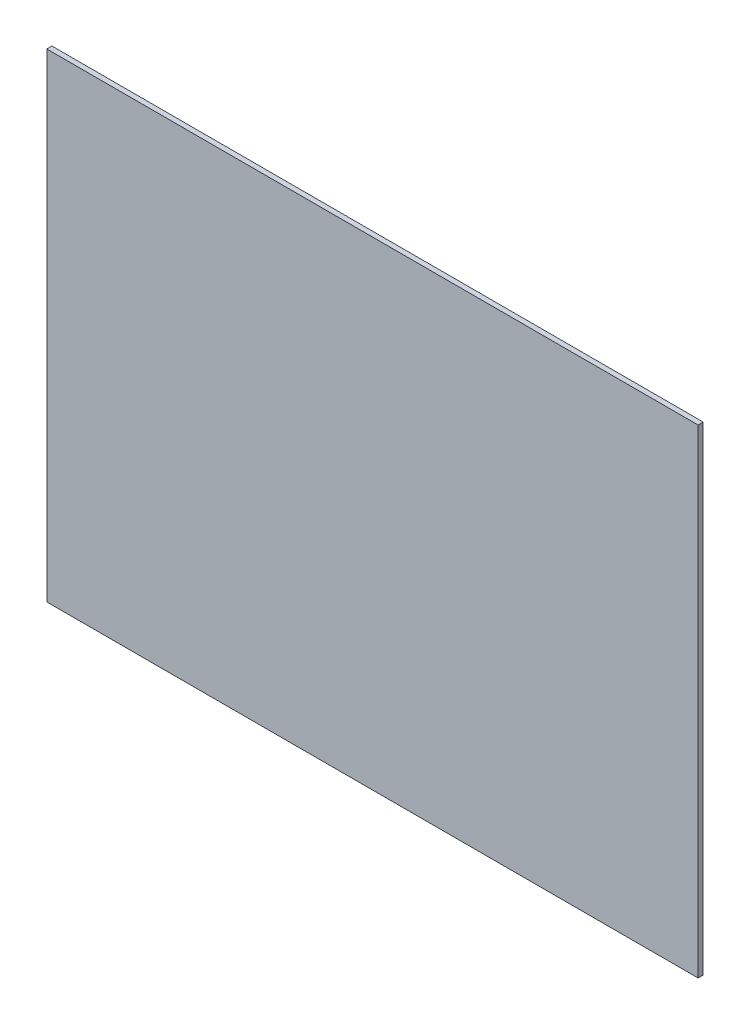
from build123d import *

# Parameters (mm, degrees)
SKIZZE1_W                       = 510
SKIZZE1_H                       = 375
AUFSATZ_LINEAR_AUSTRAGEN1_DEPTH = 4


with BuildPart() as part:
    # Skizze1 → Aufsatz-Linear austragen1 (new body)
    with BuildSketch(Plane.XY):
        Rectangle(SKIZZE1_W, SKIZZE1_H)
    extrude(amount=AUFSATZ_LINEAR_AUSTRAGEN1_DEPTH)


solid = part.part
